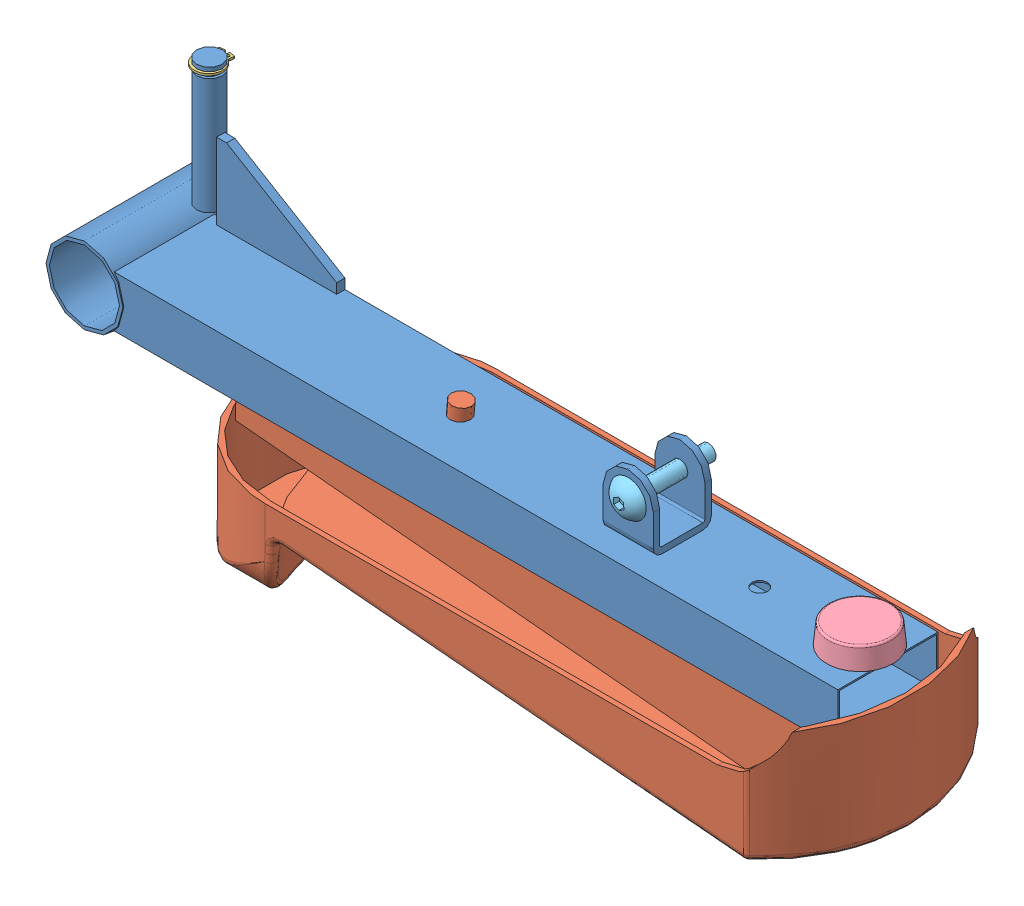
SolidWorks assembly Ensemble_pedale_droite.SLDASM, configuration Défaut (file format 11000). Lengths in mm.
Overall size (407.3 146.56 118.43).
5 component instances, 5 part files, 9 mates.
Components (placement in the parent):
- Support_droite-1: Support_droite.sldprt [Défaut] at (0.1179 0.1901 0) size (395 99.95 74.3)
- Repose_pied-1: Repose_pied.sldprt [Défaut] at (152.9179 4.4401 92.8) x (-1 0 0) z (0 -1 0) size (322.56 118.43 85.49)
- DIN_RETEXT_12 x 1_1-1: DIN_RETEXT_12 x 1_1.sldprt [Défaut] at (13.2679 78.9401 25) x (1 0 0) z (0 -1 0) size (14.14 16.55 1)
- Amortisseur_17-1: Amortisseur_17.sldprt [Défaut] at (361.9179 23.4401 48.8) x (0 -1 0) z (-0.242029 0 0.970269) size (20 33 33)
- Boulon_M8-1: Boulon_M8.sldprt [Défaut] at (260.7179 32.9401 72.3) x (0 0 -1) z (0.86757 0.497315 0) size (45.44 18 18)
Mates (geometry in assembly coordinates):
- Coïncidente24: coincident: plane of Support_droite-1 through (14.4733 -12.5599 73.8) normal (0 -1 0); plane of Repose_pied-1 through (70.7967 -12.5599 71.3) normal (0 1 0)
- Distance4: distance = 34 mm: plane of Support_droite-1 through (12.3046 -12.5599 73.8) normal (0 0 1); plane of Repose_pied-1 through (362.676 -11.8454 107.8) normal (0 0 1)
- Coïncidente31: coincident: line of Support_droite-1 through (375.9179 -12.5599 23.8) axis (0 0 1); moEndPointRef_w of Repose_pied-1
- Coïncidente32: coincident: plane of Support_droite-1 through (248.2179 17.1401 63.3) normal (0 0 1); plane of Boulon_M8-1 through (257.3612 20.4815 63.3) normal (0 0 -1)
- Coaxiale2: concentric: cylinder of Support_droite-1 through (260.7179 32.9401 60.1) axis (0 0 1) radius 4; cylinder of Boulon_M8-1 through (260.7179 32.9401 23.3) axis (0 0 1) radius 3.9
- Coaxiale4: concentric: cylinder of Support_droite-1 through (13.2679 78.9401 25) axis (0 -1 0) radius 5; cylinder of DIN_RETEXT_12 x 1_1-1 through (13.2679 77.9401 25) axis (0 1 0) radius 5.75
- Coïncidente35: coincident: plane of Support_droite-1 through (6.792 78.9401 18.5353) normal (0 -1 0); plane of DIN_RETEXT_12 x 1_1-1 through (6.0544 78.9401 15.8999) normal (0 1 0)
- Coaxiale5: concentric: cylinder of Support_droite-1 through (361.9179 12.1901 48.8) axis (0 1 0) radius 5.2; cone of Amortisseur_17-1 through (361.9179 12.9401 48.8) axis (0 1 0)
- Coïncidente36: coincident: plane of Support_droite-1 through (14.4733 12.9401 23.8) normal (0 1 0); plane of Amortisseur_17-1 through (377.9273 12.9401 52.7935) normal (0 -1 0)
